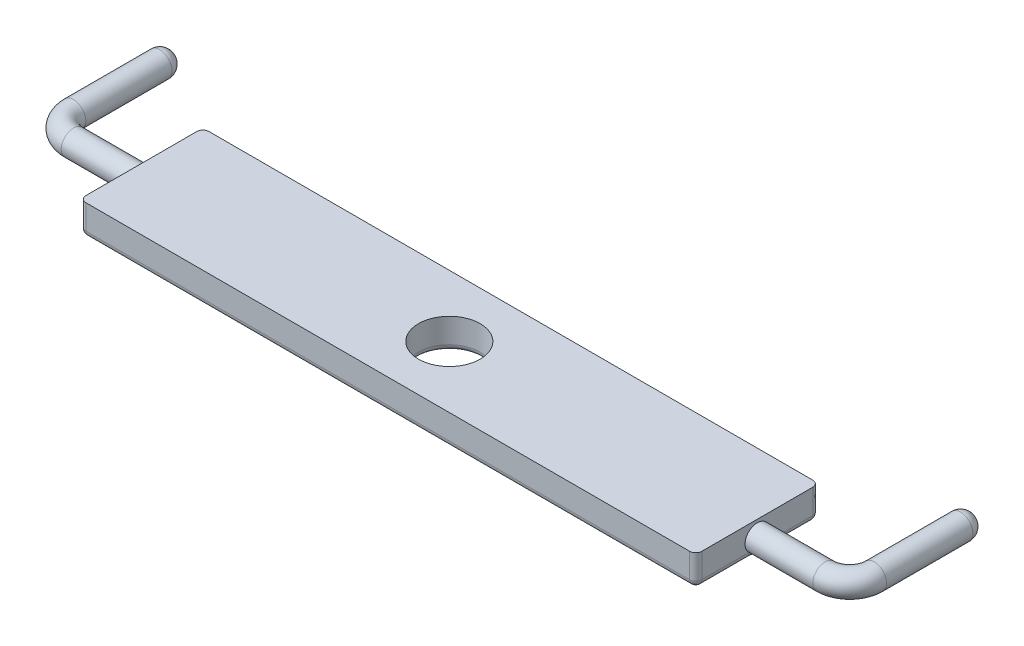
ISO-10303-21;
HEADER;
FILE_DESCRIPTION(('STEP AP214'),'2;1');
FILE_NAME('part.step','',(''),(''),'','','');
FILE_SCHEMA(('AUTOMOTIVE_DESIGN { 1 0 10303 214 1 1 1 1 }'));
ENDSEC;
DATA;
#1=APPLICATION_CONTEXT('core data for automotive mechanical design processes');
#2=APPLICATION_PROTOCOL_DEFINITION('international standard','automotive_design',2000,#1);
#3=PRODUCT_CONTEXT('',#1,'mechanical');
#4=PRODUCT('Part','Part','',(#3));
#5=PRODUCT_RELATED_PRODUCT_CATEGORY('part','',(#4));
#6=PRODUCT_DEFINITION_FORMATION('','',#4);
#7=PRODUCT_DEFINITION_CONTEXT('part definition',#1,'design');
#8=PRODUCT_DEFINITION('design','',#6,#7);
#9=PRODUCT_DEFINITION_SHAPE('','',#8);
#10=(LENGTH_UNIT() NAMED_UNIT(*) SI_UNIT(.MILLI.,.METRE.));
#11=(NAMED_UNIT(*) PLANE_ANGLE_UNIT() SI_UNIT($,.RADIAN.));
#12=(NAMED_UNIT(*) SI_UNIT($,.STERADIAN.) SOLID_ANGLE_UNIT());
#13=UNCERTAINTY_MEASURE_WITH_UNIT(LENGTH_MEASURE(1.E-05),#10,'distance_accuracy_value','');
#14=(GEOMETRIC_REPRESENTATION_CONTEXT(3) GLOBAL_UNCERTAINTY_ASSIGNED_CONTEXT((#13)) GLOBAL_UNIT_ASSIGNED_CONTEXT((#10,
#11,#12)) REPRESENTATION_CONTEXT('',''));
#15=CARTESIAN_POINT('',(0.,0.,0.));
#16=DIRECTION('',(0.,0.,1.));
#17=DIRECTION('',(1.,0.,0.));
#18=AXIS2_PLACEMENT_3D('',#15,#16,#17);
#19=CARTESIAN_POINT('',(-25.,1.25,-5.));
#20=DIRECTION('',(1.,0.,0.));
#21=DIRECTION('',(0.,0.,-1.));
#22=AXIS2_PLACEMENT_3D('',#19,#20,#21);
#23=PLANE('',#22);
#24=DIRECTION('',(0.,0.,1.));
#25=VECTOR('',#24,1.);
#26=CARTESIAN_POINT('',(-25.,1.25,-5.));
#27=LINE('',#26,#25);
#28=CARTESIAN_POINT('',(-25.,1.25,-4.5));
#29=VERTEX_POINT('',#28);
#30=CARTESIAN_POINT('',(-25.,1.25,4.5));
#31=VERTEX_POINT('',#30);
#32=EDGE_CURVE('E311',#29,#31,#27,.T.);
#33=ORIENTED_EDGE('',*,*,#32,.F.);
#34=DIRECTION('',(0.,-1.,0.));
#35=VECTOR('',#34,1.);
#36=CARTESIAN_POINT('',(-25.,1.25,-4.5));
#37=LINE('',#36,#35);
#38=CARTESIAN_POINT('',(-25.,-0.75,-4.5));
#39=VERTEX_POINT('',#38);
#40=EDGE_CURVE('E313',#29,#39,#37,.T.);
#41=ORIENTED_EDGE('',*,*,#40,.T.);
#42=DIRECTION('',(0.,0.,1.));
#43=VECTOR('',#42,1.);
#44=CARTESIAN_POINT('',(-25.,-0.75,5.));
#45=LINE('',#44,#43);
#46=CARTESIAN_POINT('',(-25.,-0.75,-0.661437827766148));
#47=VERTEX_POINT('',#46);
#48=EDGE_CURVE('E272',#39,#47,#45,.T.);
#49=ORIENTED_EDGE('',*,*,#48,.T.);
#50=CARTESIAN_POINT('',(-25.,0.,0.));
#51=DIRECTION('',(-1.,0.,0.));
#52=DIRECTION('',(0.,0.,1.));
#53=AXIS2_PLACEMENT_3D('',#50,#51,#52);
#54=CIRCLE('',#53,1.);
#55=CARTESIAN_POINT('',(-25.,-0.75,0.661437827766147));
#56=VERTEX_POINT('',#55);
#57=EDGE_CURVE('E449',#56,#47,#54,.T.);
#58=ORIENTED_EDGE('',*,*,#57,.F.);
#59=DIRECTION('',(0.,0.,1.));
#60=VECTOR('',#59,1.);
#61=CARTESIAN_POINT('',(-25.,-0.75,5.));
#62=LINE('',#61,#60);
#63=CARTESIAN_POINT('',(-25.,-0.75,4.5));
#64=VERTEX_POINT('',#63);
#65=EDGE_CURVE('E269',#56,#64,#62,.T.);
#66=ORIENTED_EDGE('',*,*,#65,.T.);
#67=DIRECTION('',(0.,-1.,0.));
#68=VECTOR('',#67,1.);
#69=CARTESIAN_POINT('',(-25.,1.25,4.5));
#70=LINE('',#69,#68);
#71=EDGE_CURVE('E316',#64,#31,#70,.F.);
#72=ORIENTED_EDGE('',*,*,#71,.T.);
#73=EDGE_LOOP('',(#33,#41,#49,#58,#66,#72));
#74=FACE_BOUND('',#73,.T.);
#75=ADVANCED_FACE('F34',(#74),#23,.F.);
#76=CARTESIAN_POINT('',(25.,1.25,-5.));
#77=DIRECTION('',(-1.,0.,0.));
#78=DIRECTION('',(0.,0.,1.));
#79=AXIS2_PLACEMENT_3D('',#76,#77,#78);
#80=PLANE('',#79);
#81=DIRECTION('',(0.,0.,-1.));
#82=VECTOR('',#81,1.);
#83=CARTESIAN_POINT('',(25.,-0.75,-5.));
#84=LINE('',#83,#82);
#85=CARTESIAN_POINT('',(25.,-0.75,-0.661437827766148));
#86=VERTEX_POINT('',#85);
#87=CARTESIAN_POINT('',(25.,-0.75,-4.5));
#88=VERTEX_POINT('',#87);
#89=EDGE_CURVE('E276',#86,#88,#84,.T.);
#90=ORIENTED_EDGE('',*,*,#89,.T.);
#91=DIRECTION('',(0.,-1.,0.));
#92=VECTOR('',#91,1.);
#93=CARTESIAN_POINT('',(25.,1.25,-4.5));
#94=LINE('',#93,#92);
#95=CARTESIAN_POINT('',(25.,1.25,-4.5));
#96=VERTEX_POINT('',#95);
#97=EDGE_CURVE('E342',#88,#96,#94,.F.);
#98=ORIENTED_EDGE('',*,*,#97,.T.);
#99=DIRECTION('',(0.,0.,-1.));
#100=VECTOR('',#99,1.);
#101=CARTESIAN_POINT('',(25.,1.25,-5.));
#102=LINE('',#101,#100);
#103=CARTESIAN_POINT('',(25.,1.25,4.5));
#104=VERTEX_POINT('',#103);
#105=EDGE_CURVE('E469',#104,#96,#102,.T.);
#106=ORIENTED_EDGE('',*,*,#105,.F.);
#107=DIRECTION('',(0.,-1.,0.));
#108=VECTOR('',#107,1.);
#109=CARTESIAN_POINT('',(25.,1.25,4.5));
#110=LINE('',#109,#108);
#111=CARTESIAN_POINT('',(25.,-0.75,4.5));
#112=VERTEX_POINT('',#111);
#113=EDGE_CURVE('E340',#104,#112,#110,.T.);
#114=ORIENTED_EDGE('',*,*,#113,.T.);
#115=DIRECTION('',(0.,0.,-1.));
#116=VECTOR('',#115,1.);
#117=CARTESIAN_POINT('',(25.,-0.75,-5.));
#118=LINE('',#117,#116);
#119=CARTESIAN_POINT('',(25.,-0.75,0.661437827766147));
#120=VERTEX_POINT('',#119);
#121=EDGE_CURVE('E279',#112,#120,#118,.T.);
#122=ORIENTED_EDGE('',*,*,#121,.T.);
#123=CARTESIAN_POINT('',(25.,0.,0.));
#124=DIRECTION('',(1.,0.,0.));
#125=DIRECTION('',(0.,0.,-1.));
#126=AXIS2_PLACEMENT_3D('',#123,#124,#125);
#127=CIRCLE('',#126,1.);
#128=EDGE_CURVE('E460',#86,#120,#127,.T.);
#129=ORIENTED_EDGE('',*,*,#128,.F.);
#130=EDGE_LOOP('',(#90,#98,#106,#114,#122,#129));
#131=FACE_BOUND('',#130,.T.);
#132=ADVANCED_FACE('F200',(#131),#80,.F.);
#133=CARTESIAN_POINT('',(25.,1.25,5.));
#134=DIRECTION('',(0.,-1.,0.));
#135=DIRECTION('',(0.,0.,-1.));
#136=AXIS2_PLACEMENT_3D('',#133,#134,#135);
#137=PLANE('',#136);
#138=DIRECTION('',(-1.,0.,0.));
#139=VECTOR('',#138,1.);
#140=CARTESIAN_POINT('',(25.,1.25,-5.));
#141=LINE('',#140,#139);
#142=CARTESIAN_POINT('',(24.5,1.25,-5.));
#143=VERTEX_POINT('',#142);
#144=CARTESIAN_POINT('',(-24.5,1.25,-5.));
#145=VERTEX_POINT('',#144);
#146=EDGE_CURVE('E318',#143,#145,#141,.T.);
#147=ORIENTED_EDGE('',*,*,#146,.T.);
#148=CARTESIAN_POINT('',(-24.5,1.25,-4.5));
#149=DIRECTION('',(0.,-1.,0.));
#150=DIRECTION('',(0.,0.,-1.));
#151=AXIS2_PLACEMENT_3D('',#148,#149,#150);
#152=CIRCLE('',#151,0.5);
#153=EDGE_CURVE('E325',#145,#29,#152,.F.);
#154=ORIENTED_EDGE('',*,*,#153,.T.);
#155=ORIENTED_EDGE('',*,*,#32,.T.);
#156=CARTESIAN_POINT('',(-24.5,1.25,4.5));
#157=DIRECTION('',(0.,-1.,0.));
#158=DIRECTION('',(0.,0.,-1.));
#159=AXIS2_PLACEMENT_3D('',#156,#157,#158);
#160=CIRCLE('',#159,0.5);
#161=CARTESIAN_POINT('',(-24.5,1.25,5.));
#162=VERTEX_POINT('',#161);
#163=EDGE_CURVE('E56',#31,#162,#160,.F.);
#164=ORIENTED_EDGE('',*,*,#163,.T.);
#165=DIRECTION('',(1.,0.,0.));
#166=VECTOR('',#165,1.);
#167=CARTESIAN_POINT('',(25.,1.25,5.));
#168=LINE('',#167,#166);
#169=CARTESIAN_POINT('',(24.5,1.25,5.));
#170=VERTEX_POINT('',#169);
#171=EDGE_CURVE('E317',#162,#170,#168,.T.);
#172=ORIENTED_EDGE('',*,*,#171,.T.);
#173=CARTESIAN_POINT('',(24.5,1.25,4.5));
#174=DIRECTION('',(0.,-1.,0.));
#175=DIRECTION('',(0.,0.,-1.));
#176=AXIS2_PLACEMENT_3D('',#173,#174,#175);
#177=CIRCLE('',#176,0.5);
#178=EDGE_CURVE('E334',#170,#104,#177,.F.);
#179=ORIENTED_EDGE('',*,*,#178,.T.);
#180=ORIENTED_EDGE('',*,*,#105,.T.);
#181=CARTESIAN_POINT('',(24.5,1.25,-4.5));
#182=DIRECTION('',(0.,-1.,0.));
#183=DIRECTION('',(0.,0.,-1.));
#184=AXIS2_PLACEMENT_3D('',#181,#182,#183);
#185=CIRCLE('',#184,0.5);
#186=EDGE_CURVE('E337',#96,#143,#185,.F.);
#187=ORIENTED_EDGE('',*,*,#186,.T.);
#188=EDGE_LOOP('',(#147,#154,#155,#164,#172,#179,#180,#187));
#189=FACE_BOUND('',#188,.T.);
#190=CARTESIAN_POINT('',(0.,1.25,0.));
#191=DIRECTION('',(0.,1.,0.));
#192=DIRECTION('',(0.,0.,1.));
#193=AXIS2_PLACEMENT_3D('',#190,#191,#192);
#194=CIRCLE('',#193,2.5);
#195=CARTESIAN_POINT('',(0.,1.25,2.5));
#196=VERTEX_POINT('',#195);
#197=EDGE_CURVE('E466',#196,#196,#194,.T.);
#198=ORIENTED_EDGE('',*,*,#197,.F.);
#199=EDGE_LOOP('',(#198));
#200=FACE_BOUND('',#199,.T.);
#201=ADVANCED_FACE('F228',(#189,#200),#137,.F.);
#202=CARTESIAN_POINT('',(25.,-1.25,5.));
#203=DIRECTION('',(0.,-1.,0.));
#204=DIRECTION('',(0.,0.,-1.));
#205=AXIS2_PLACEMENT_3D('',#202,#203,#204);
#206=PLANE('',#205);
#207=CARTESIAN_POINT('',(0.,-1.25,0.));
#208=DIRECTION('',(0.,-1.,0.));
#209=DIRECTION('',(0.,0.,-1.));
#210=AXIS2_PLACEMENT_3D('',#207,#208,#209);
#211=CIRCLE('',#210,3.);
#212=CARTESIAN_POINT('',(0.,-1.25,-3.));
#213=VERTEX_POINT('',#212);
#214=EDGE_CURVE('E258',#213,#213,#211,.F.);
#215=ORIENTED_EDGE('',*,*,#214,.T.);
#216=EDGE_LOOP('',(#215));
#217=FACE_BOUND('',#216,.T.);
#218=DIRECTION('',(0.,0.,1.));
#219=VECTOR('',#218,1.);
#220=CARTESIAN_POINT('',(-24.5,-1.25,-5.));
#221=LINE('',#220,#219);
#222=CARTESIAN_POINT('',(-24.5,-1.25,4.5));
#223=VERTEX_POINT('',#222);
#224=CARTESIAN_POINT('',(-24.5,-1.25,0.661437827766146));
#225=VERTEX_POINT('',#224);
#226=EDGE_CURVE('E413',#223,#225,#221,.F.);
#227=ORIENTED_EDGE('',*,*,#226,.T.);
#228=CARTESIAN_POINT('',(-25.,-0.627274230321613,0.778798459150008));
#229=CARTESIAN_POINT('',(-25.1496790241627,-1.25,0.729232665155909));
#230=CARTESIAN_POINT('',(-24.5398681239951,-1.25,0.93116985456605));
#231=CARTESIAN_POINT('',(-25.,-0.636103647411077,0.771681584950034));
#232=CARTESIAN_POINT('',(-25.1378611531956,-1.25,0.731566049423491));
#233=CARTESIAN_POINT('',(-24.5327034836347,-1.25,0.90954230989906));
#234=CARTESIAN_POINT('',(-25.,-0.645336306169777,0.764002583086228));
#235=CARTESIAN_POINT('',(-25.1252870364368,-1.25,0.731809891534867));
#236=CARTESIAN_POINT('',(-24.5266227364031,-1.25,0.887579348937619));
#237=CARTESIAN_POINT('',(-25.,-0.664518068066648,0.74738139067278));
#238=CARTESIAN_POINT('',(-25.0996926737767,-1.25,0.728104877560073));
#239=CARTESIAN_POINT('',(-24.5164509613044,-1.25,0.843205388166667));
#240=CARTESIAN_POINT('',(-25.,-0.674466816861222,0.738439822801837));
#241=CARTESIAN_POINT('',(-25.0866950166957,-1.25,0.724256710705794));
#242=CARTESIAN_POINT('',(-24.5123589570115,-1.25,0.820794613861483));
#243=CARTESIAN_POINT('',(-25.,-0.694914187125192,0.719228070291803));
#244=CARTESIAN_POINT('',(-25.0610904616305,-1.25,0.712657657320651));
#245=CARTESIAN_POINT('',(-24.5060064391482,-1.25,0.775913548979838));
#246=CARTESIAN_POINT('',(-25.,-0.705407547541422,0.708969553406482));
#247=CARTESIAN_POINT('',(-25.0484848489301,-1.25,0.705033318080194));
#248=CARTESIAN_POINT('',(-24.503730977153,-1.25,0.7534453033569));
#249=CARTESIAN_POINT('',(-25.,-0.726894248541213,0.686921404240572));
#250=CARTESIAN_POINT('',(-25.0240852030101,-1.25,0.686282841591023));
#251=CARTESIAN_POINT('',(-24.5007470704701,-1.25,0.708422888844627));
#252=CARTESIAN_POINT('',(-25.,-0.737887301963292,0.675132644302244));
#253=CARTESIAN_POINT('',(-25.0122761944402,-1.25,0.67524036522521));
#254=CARTESIAN_POINT('',(-24.5000377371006,-1.25,0.685868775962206));
#255=CARTESIAN_POINT('',(-25.,-0.772304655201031,0.636224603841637));
#256=CARTESIAN_POINT('',(-24.9781551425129,-1.25,0.63688871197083));
#257=CARTESIAN_POINT('',(-24.4999263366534,-1.25,0.616449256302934));
#258=CARTESIAN_POINT('',(-25.,-0.796355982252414,0.60627766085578));
#259=CARTESIAN_POINT('',(-24.9572182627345,-1.25,0.604358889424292));
#260=CARTESIAN_POINT('',(-24.5027575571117,-1.25,0.569583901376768));
#261=CARTESIAN_POINT('',(-25.,-0.844286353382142,0.537528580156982));
#262=CARTESIAN_POINT('',(-24.9220454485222,-1.25,0.528942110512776));
#263=CARTESIAN_POINT('',(-24.5120492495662,-1.25,0.476170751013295));
#264=CARTESIAN_POINT('',(-25.,-0.868164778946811,0.498703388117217));
#265=CARTESIAN_POINT('',(-24.9074986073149,-1.25,0.486326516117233));
#266=CARTESIAN_POINT('',(-24.5185192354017,-1.25,0.429624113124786));
#267=CARTESIAN_POINT('',(-25.,-0.912823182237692,0.411286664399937));
#268=CARTESIAN_POINT('',(-24.8847516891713,-1.25,0.393784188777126));
#269=CARTESIAN_POINT('',(-24.5325690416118,-1.25,0.336796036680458));
#270=CARTESIAN_POINT('',(-25.,-0.933608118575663,0.362711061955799));
#271=CARTESIAN_POINT('',(-24.8762559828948,-1.25,0.343822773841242));
#272=CARTESIAN_POINT('',(-24.5401470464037,-1.25,0.29051429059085));
#273=CARTESIAN_POINT('',(-25.,-0.968167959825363,0.256359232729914));
#274=CARTESIAN_POINT('',(-24.864116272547,-1.25,0.239053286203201));
#275=CARTESIAN_POINT('',(-24.5535027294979,-1.25,0.197768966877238));
#276=CARTESIAN_POINT('',(-25.,-0.981961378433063,0.198607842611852));
#277=CARTESIAN_POINT('',(-24.8602795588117,-1.25,0.183827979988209));
#278=CARTESIAN_POINT('',(-24.5592851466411,-1.25,0.151306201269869));
#279=CARTESIAN_POINT('',(-25.,-0.994706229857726,0.107420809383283));
#280=CARTESIAN_POINT('',(-24.8569502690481,-1.25,0.0987567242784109));
#281=CARTESIAN_POINT('',(-24.5647003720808,-1.25,0.0808839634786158));
#282=CARTESIAN_POINT('',(-25.,-0.997618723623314,0.0759435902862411));
#283=CARTESIAN_POINT('',(-24.8562401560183,-1.25,0.0697062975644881));
#284=CARTESIAN_POINT('',(-24.5659582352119,-1.25,0.0570586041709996));
#285=CARTESIAN_POINT('',(-25.,-1.00042260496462,0.0125484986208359));
#286=CARTESIAN_POINT('',(-24.8555585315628,-1.25,0.0115068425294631));
#287=CARTESIAN_POINT('',(-24.5671690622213,-1.25,0.00937552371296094));
#288=CARTESIAN_POINT('',(-25.,-1.00031420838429,-0.0193693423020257));
#289=CARTESIAN_POINT('',(-24.8555842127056,-1.25,-0.0177592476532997));
#290=CARTESIAN_POINT('',(-24.5671221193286,-1.25,-0.0144821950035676));
#291=CARTESIAN_POINT('',(-25.,-0.997078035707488,-0.082729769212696));
#292=CARTESIAN_POINT('',(-24.8563723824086,-1.25,-0.0759573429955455));
#293=CARTESIAN_POINT('',(-24.5657247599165,-1.25,-0.0621921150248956));
#294=CARTESIAN_POINT('',(-25.,-0.993945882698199,-0.11417159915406));
#295=CARTESIAN_POINT('',(-24.8571391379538,-1.25,-0.105005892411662));
#296=CARTESIAN_POINT('',(-24.5643724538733,-1.25,-0.0860442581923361));
#297=CARTESIAN_POINT('',(-25.,-0.984939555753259,-0.175677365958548));
#298=CARTESIAN_POINT('',(-24.8595069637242,-1.25,-0.162304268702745));
#299=CARTESIAN_POINT('',(-24.5605568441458,-1.25,-0.133661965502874));
#300=CARTESIAN_POINT('',(-25.,-0.979064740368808,-0.205740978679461));
#301=CARTESIAN_POINT('',(-24.8611178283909,-1.25,-0.190657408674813));
#302=CARTESIAN_POINT('',(-24.5580932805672,-1.25,-0.15742750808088));
#303=CARTESIAN_POINT('',(-25.,-0.957955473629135,-0.293109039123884));
#304=CARTESIAN_POINT('',(-24.8675125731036,-1.25,-0.274603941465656));
#305=CARTESIAN_POINT('',(-24.549486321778,-1.25,-0.228795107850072));
#306=CARTESIAN_POINT('',(-25.,-0.939259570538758,-0.347273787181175));
#307=CARTESIAN_POINT('',(-24.8739044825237,-1.25,-0.328465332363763));
#308=CARTESIAN_POINT('',(-24.5421387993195,-1.25,-0.276239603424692));
#309=CARTESIAN_POINT('',(-25.,-0.897045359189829,-0.445180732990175));
#310=CARTESIAN_POINT('',(-24.8922070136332,-1.25,-0.429053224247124));
#311=CARTESIAN_POINT('',(-24.5273582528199,-1.25,-0.371083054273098));
#312=CARTESIAN_POINT('',(-25.,-0.873529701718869,-0.488928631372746));
#313=CARTESIAN_POINT('',(-24.9043782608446,-1.25,-0.476008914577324));
#314=CARTESIAN_POINT('',(-24.5199252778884,-1.25,-0.418482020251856));
#315=CARTESIAN_POINT('',(-25.,-0.836071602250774,-0.549192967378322));
#316=CARTESIAN_POINT('',(-24.9279388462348,-1.25,-0.541154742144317));
#317=CARTESIAN_POINT('',(-24.5105523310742,-1.25,-0.492232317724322));
#318=CARTESIAN_POINT('',(-25.,-0.822586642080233,-0.569100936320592));
#319=CARTESIAN_POINT('',(-24.9374074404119,-1.25,-0.563062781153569));
#320=CARTESIAN_POINT('',(-24.5076460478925,-1.25,-0.518450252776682));
#321=CARTESIAN_POINT('',(-25.,-0.795656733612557,-0.606181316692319));
#322=CARTESIAN_POINT('',(-24.9582383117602,-1.25,-0.603627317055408));
#323=CARTESIAN_POINT('',(-24.5030897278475,-1.25,-0.570955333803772));
#324=CARTESIAN_POINT('',(-25.,-0.782211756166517,-0.623358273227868));
#325=CARTESIAN_POINT('',(-24.969653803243,-1.25,-0.622228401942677));
#326=CARTESIAN_POINT('',(-24.5014375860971,-1.25,-0.597242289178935));
#327=CARTESIAN_POINT('',(-25.,-0.755819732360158,-0.65510142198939));
#328=CARTESIAN_POINT('',(-24.994063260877,-1.25,-0.655496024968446));
#329=CARTESIAN_POINT('',(-24.4997860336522,-1.25,-0.649604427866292));
#330=CARTESIAN_POINT('',(-25.,-0.742868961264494,-0.669692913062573));
#331=CARTESIAN_POINT('',(-25.0070900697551,-1.25,-0.670114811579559));
#332=CARTESIAN_POINT('',(-24.4997696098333,-1.25,-0.675678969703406));
#333=CARTESIAN_POINT('',(-25.,-0.717567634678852,-0.69673489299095));
#334=CARTESIAN_POINT('',(-25.0344023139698,-1.25,-0.69511748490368));
#335=CARTESIAN_POINT('',(-24.5016992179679,-1.25,-0.727765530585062));
#336=CARTESIAN_POINT('',(-25.,-0.705217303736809,-0.709184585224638));
#337=CARTESIAN_POINT('',(-25.0487190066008,-1.25,-0.705382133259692));
#338=CARTESIAN_POINT('',(-24.5036459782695,-1.25,-0.753777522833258));
#339=CARTESIAN_POINT('',(-25.,-0.675887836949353,-0.737399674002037));
#340=CARTESIAN_POINT('',(-25.0847980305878,-1.25,-0.724784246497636));
#341=CARTESIAN_POINT('',(-24.5112452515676,-1.25,-0.817293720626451));
#342=CARTESIAN_POINT('',(-25.,-0.659345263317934,-0.752113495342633));
#343=CARTESIAN_POINT('',(-25.1066933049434,-1.25,-0.730771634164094));
#344=CARTESIAN_POINT('',(-24.5181766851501,-1.25,-0.85466782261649));
#345=CARTESIAN_POINT('',(-25.,-0.635877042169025,-0.771860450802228));
#346=CARTESIAN_POINT('',(-25.1381039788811,-1.25,-0.731354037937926));
#347=CARTESIAN_POINT('',(-24.5329988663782,-1.25,-0.91014946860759));
#348=CARTESIAN_POINT('',(-25.,-0.628172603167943,-0.778131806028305));
#349=CARTESIAN_POINT('',(-25.1486064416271,-1.25,-0.729972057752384));
#350=CARTESIAN_POINT('',(-24.5388008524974,-1.25,-0.928825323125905));
#351=CARTESIAN_POINT('',(-25.,-0.613344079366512,-0.789872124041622));
#352=CARTESIAN_POINT('',(-25.1685219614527,-1.25,-0.724174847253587));
#353=CARTESIAN_POINT('',(-24.5520172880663,-1.25,-0.965636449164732));
#354=CARTESIAN_POINT('',(-25.,-0.606221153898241,-0.795339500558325));
#355=CARTESIAN_POINT('',(-25.1778994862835,-1.25,-0.719694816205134));
#356=CARTESIAN_POINT('',(-24.5594348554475,-1.25,-0.983770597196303));
#357=CARTESIAN_POINT('',(-25.,-0.599411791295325,-0.800440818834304));
#358=CARTESIAN_POINT('',(-25.1863120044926,-1.25,-0.713774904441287));
#359=CARTESIAN_POINT('',(-24.5676978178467,-1.25,-1.00153287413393));
#360=(BOUNDED_SURFACE() B_SPLINE_SURFACE(3,2,((#228,#229,#230),(#231,#232,#233),(#234,#235,
#236),(#237,#238,#239),(#240,#241,#242),(#243,#244,#245),(#246,#247,#248),(#249,#250,#251),
(#252,#253,#254),(#255,#256,#257),(#258,#259,#260),(#261,#262,#263),(#264,#265,#266),(#267,#268,
#269),(#270,#271,#272),(#273,#274,#275),(#276,#277,#278),(#279,#280,#281),(#282,#283,#284),
(#285,#286,#287),(#288,#289,#290),(#291,#292,#293),(#294,#295,#296),(#297,#298,#299),(#300,#301,
#302),(#303,#304,#305),(#306,#307,#308),(#309,#310,#311),(#312,#313,#314),(#315,#316,#317),
(#318,#319,#320),(#321,#322,#323),(#324,#325,#326),(#327,#328,#329),(#330,#331,#332),(#333,#334,
#335),(#336,#337,#338),(#339,#340,#341),(#342,#343,#344),(#345,#346,#347),(#348,#349,#350),
(#351,#352,#353),(#354,#355,#356),(#357,#358,#359)),.UNSPECIFIED.,.F.,.F.,
.F.) B_SPLINE_SURFACE_WITH_KNOTS((4,2,2,2,2,2,2,2,2,2,2,2,2,2,2,2,2,2,2,2,2,4),(3,3),(0.,
0.0682896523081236,0.136545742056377,0.204234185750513,0.271884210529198,0.412454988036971,
0.553395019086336,0.694106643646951,0.834443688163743,0.905985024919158,0.977521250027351,
1.04916117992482,1.12081787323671,1.26481582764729,1.40873479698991,1.48784669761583,
1.56682552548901,1.64498280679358,1.72316909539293,1.8367619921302,1.8953652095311,
1.95408254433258),(0.,1.),
.UNSPECIFIED.) GEOMETRIC_REPRESENTATION_ITEM() RATIONAL_B_SPLINE_SURFACE(((1.,0.614226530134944,
1.),(1.,0.621416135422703,1.),(1.,0.628803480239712,1.),(1.,0.643874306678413,1.),(1.,
0.651557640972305,1.),(1.,0.667063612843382,1.),(1.,0.674884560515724,1.),(1.,0.690620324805,
1.),(1.,0.698535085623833,1.),(1.,0.722891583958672,1.),(1.,0.739328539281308,1.),(1.,
0.771063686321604,1.),(1.,0.786358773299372,1.),(1.,0.814258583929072,1.),(1.,0.826867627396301,
1.),(1.,0.847513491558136,1.),(1.,0.855562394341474,1.),(1.,0.862966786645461,1.),(1.,
0.864649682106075,1.),(1.,0.866269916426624,1.),(1.,0.866207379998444,1.),(1.,0.864337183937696,
1.),(1.,0.862526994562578,1.),(1.,0.857290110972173,1.),(1.,0.853863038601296,1.),(1.,
0.841441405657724,1.),(1.,0.830319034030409,1.),(1.,0.804492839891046,1.),(1.,0.789790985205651,
1.),(1.,0.765602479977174,1.),(1.,0.756748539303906,1.),(1.,0.738740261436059,1.),(1.,
0.729586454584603,1.),(1.,0.711268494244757,1.),(1.,0.702105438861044,1.),(1.,0.683850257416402,
1.),(1.,0.674758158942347,1.),(1.,0.652730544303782,1.),(1.,0.639919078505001,1.),(1.,
0.621222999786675,1.),(1.,0.614987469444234,1.),(1.,0.602811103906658,1.),(1.,0.596870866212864,
1.),(1.,0.591110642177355,1.))) REPRESENTATION_ITEM('') SURFACE());
#361=CARTESIAN_POINT('',(-24.5398681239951,-1.25,0.93116985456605));
#362=CARTESIAN_POINT('',(-24.5327034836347,-1.25,0.90954230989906));
#363=CARTESIAN_POINT('',(-24.5266227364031,-1.25,0.887579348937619));
#364=CARTESIAN_POINT('',(-24.5164509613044,-1.25,0.843205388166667));
#365=CARTESIAN_POINT('',(-24.5123589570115,-1.25,0.820794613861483));
#366=CARTESIAN_POINT('',(-24.5060064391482,-1.25,0.775913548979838));
#367=CARTESIAN_POINT('',(-24.503730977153,-1.25,0.7534453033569));
#368=CARTESIAN_POINT('',(-24.5007470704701,-1.25,0.708422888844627));
#369=CARTESIAN_POINT('',(-24.5000377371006,-1.25,0.685868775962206));
#370=CARTESIAN_POINT('',(-24.4999263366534,-1.25,0.616449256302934));
#371=CARTESIAN_POINT('',(-24.5027575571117,-1.25,0.569583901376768));
#372=CARTESIAN_POINT('',(-24.5120492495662,-1.25,0.476170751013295));
#373=CARTESIAN_POINT('',(-24.5185192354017,-1.25,0.429624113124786));
#374=CARTESIAN_POINT('',(-24.5325690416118,-1.25,0.336796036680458));
#375=CARTESIAN_POINT('',(-24.5401470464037,-1.25,0.29051429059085));
#376=CARTESIAN_POINT('',(-24.5535027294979,-1.25,0.197768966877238));
#377=CARTESIAN_POINT('',(-24.5592851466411,-1.25,0.151306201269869));
#378=CARTESIAN_POINT('',(-24.5647003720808,-1.25,0.0808839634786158));
#379=CARTESIAN_POINT('',(-24.5659582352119,-1.25,0.0570586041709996));
#380=CARTESIAN_POINT('',(-24.5671690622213,-1.25,0.00937552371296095));
#381=CARTESIAN_POINT('',(-24.5671221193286,-1.25,-0.0144821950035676));
#382=CARTESIAN_POINT('',(-24.5657247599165,-1.25,-0.0621921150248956));
#383=CARTESIAN_POINT('',(-24.5643724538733,-1.25,-0.0860442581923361));
#384=CARTESIAN_POINT('',(-24.5605568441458,-1.25,-0.133661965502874));
#385=CARTESIAN_POINT('',(-24.5580932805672,-1.25,-0.15742750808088));
#386=CARTESIAN_POINT('',(-24.549486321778,-1.25,-0.228795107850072));
#387=CARTESIAN_POINT('',(-24.5421387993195,-1.25,-0.276239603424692));
#388=CARTESIAN_POINT('',(-24.5273582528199,-1.25,-0.371083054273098));
#389=CARTESIAN_POINT('',(-24.5199252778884,-1.25,-0.418482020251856));
#390=CARTESIAN_POINT('',(-24.5105523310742,-1.25,-0.492232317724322));
#391=CARTESIAN_POINT('',(-24.5076460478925,-1.25,-0.518450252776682));
#392=CARTESIAN_POINT('',(-24.5030897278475,-1.25,-0.570955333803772));
#393=CARTESIAN_POINT('',(-24.5014375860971,-1.25,-0.597242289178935));
#394=CARTESIAN_POINT('',(-24.4997860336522,-1.25,-0.649604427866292));
#395=CARTESIAN_POINT('',(-24.4997696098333,-1.25,-0.675678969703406));
#396=CARTESIAN_POINT('',(-24.5016992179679,-1.25,-0.727765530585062));
#397=CARTESIAN_POINT('',(-24.5036459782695,-1.25,-0.753777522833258));
#398=CARTESIAN_POINT('',(-24.5112452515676,-1.25,-0.817293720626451));
#399=CARTESIAN_POINT('',(-24.5181766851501,-1.25,-0.85466782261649));
#400=CARTESIAN_POINT('',(-24.5329988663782,-1.25,-0.91014946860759));
#401=CARTESIAN_POINT('',(-24.5388008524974,-1.25,-0.928825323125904));
#402=CARTESIAN_POINT('',(-24.5520172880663,-1.25,-0.965636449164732));
#403=CARTESIAN_POINT('',(-24.5594348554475,-1.25,-0.983770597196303));
#404=CARTESIAN_POINT('',(-24.5676978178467,-1.25,-1.00153287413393));
#405=B_SPLINE_CURVE_WITH_KNOTS('',3,(#361,#362,#363,#364,#365,#366,#367,#368,#369,#370,#371,
#372,#373,#374,#375,#376,#377,#378,#379,#380,#381,#382,#383,#384,#385,#386,#387,#388,#389,#390,
#391,#392,#393,#394,#395,#396,#397,#398,#399,#400,#401,#402,#403,#404),.UNSPECIFIED.,.F.,.F.,(4,
2,2,2,2,2,2,2,2,2,2,2,2,2,2,2,2,2,2,2,2,4),(0.,0.0682896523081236,0.136545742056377,
0.204234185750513,0.271884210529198,0.412454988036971,0.553395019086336,0.694106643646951,
0.834443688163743,0.905985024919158,0.977521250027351,1.04916117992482,1.12081787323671,
1.26481582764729,1.40873479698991,1.48784669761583,1.56682552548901,1.64498280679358,
1.72316909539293,1.8367619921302,1.8953652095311,1.95408254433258),.UNSPECIFIED.);
#406=CARTESIAN_POINT('',(-24.5,-1.25,-0.661437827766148));
#407=VERTEX_POINT('',#406);
#408=EDGE_CURVE('E252',#225,#407,#405,.T.);
#409=ORIENTED_EDGE('',*,*,#408,.T.);
#410=DIRECTION('',(0.,0.,1.));
#411=VECTOR('',#410,1.);
#412=CARTESIAN_POINT('',(-24.5,-1.25,-5.));
#413=LINE('',#412,#411);
#414=CARTESIAN_POINT('',(-24.5,-1.25,-4.5));
#415=VERTEX_POINT('',#414);
#416=EDGE_CURVE('E259',#407,#415,#413,.F.);
#417=ORIENTED_EDGE('',*,*,#416,.T.);
#418=DIRECTION('',(-1.,0.,0.));
#419=VECTOR('',#418,1.);
#420=CARTESIAN_POINT('',(25.,-1.25,-4.5));
#421=LINE('',#420,#419);
#422=CARTESIAN_POINT('',(24.5,-1.25,-4.5));
#423=VERTEX_POINT('',#422);
#424=EDGE_CURVE('E418',#415,#423,#421,.F.);
#425=ORIENTED_EDGE('',*,*,#424,.T.);
#426=DIRECTION('',(0.,0.,-1.));
#427=VECTOR('',#426,1.);
#428=CARTESIAN_POINT('',(24.5,-1.25,5.));
#429=LINE('',#428,#427);
#430=CARTESIAN_POINT('',(24.5,-1.25,-0.661437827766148));
#431=VERTEX_POINT('',#430);
#432=EDGE_CURVE('E145',#423,#431,#429,.F.);
#433=ORIENTED_EDGE('',*,*,#432,.T.);
#434=CARTESIAN_POINT('',(25.,-0.627274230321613,-0.778798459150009));
#435=CARTESIAN_POINT('',(25.1496790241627,-1.25,-0.729232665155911));
#436=CARTESIAN_POINT('',(24.5398681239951,-1.25,-0.931169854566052));
#437=CARTESIAN_POINT('',(25.,-0.636103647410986,-0.771681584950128));
#438=CARTESIAN_POINT('',(25.1378611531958,-1.25,-0.731566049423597));
#439=CARTESIAN_POINT('',(24.5327034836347,-1.25,-0.909542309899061));
#440=CARTESIAN_POINT('',(25.,-0.645336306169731,-0.764002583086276));
#441=CARTESIAN_POINT('',(25.1252870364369,-1.25,-0.73180989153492));
#442=CARTESIAN_POINT('',(24.5266227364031,-1.25,-0.887579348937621));
#443=CARTESIAN_POINT('',(25.,-0.664518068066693,-0.747381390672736));
#444=CARTESIAN_POINT('',(25.0996926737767,-1.25,-0.728104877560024));
#445=CARTESIAN_POINT('',(24.5164509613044,-1.25,-0.843205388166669));
#446=CARTESIAN_POINT('',(25.,-0.674466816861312,-0.738439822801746));
#447=CARTESIAN_POINT('',(25.0866950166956,-1.25,-0.724256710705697));
#448=CARTESIAN_POINT('',(24.5123589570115,-1.25,-0.820794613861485));
#449=CARTESIAN_POINT('',(25.,-0.694914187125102,-0.719228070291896));
#450=CARTESIAN_POINT('',(25.0610904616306,-1.25,-0.712657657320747));
#451=CARTESIAN_POINT('',(24.5060064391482,-1.25,-0.77591354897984));
#452=CARTESIAN_POINT('',(25.,-0.705407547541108,-0.708969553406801));
#453=CARTESIAN_POINT('',(25.0484848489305,-1.25,-0.705033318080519));
#454=CARTESIAN_POINT('',(24.503730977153,-1.25,-0.753445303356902));
#455=CARTESIAN_POINT('',(25.,-0.726894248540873,-0.686921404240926));
#456=CARTESIAN_POINT('',(25.0240852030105,-1.25,-0.686282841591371));
#457=CARTESIAN_POINT('',(24.5007470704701,-1.25,-0.708422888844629));
#458=CARTESIAN_POINT('',(25.,-0.737887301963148,-0.675132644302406));
#459=CARTESIAN_POINT('',(25.0122761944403,-1.25,-0.675240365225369));
#460=CARTESIAN_POINT('',(24.5000377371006,-1.25,-0.685868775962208));
#461=CARTESIAN_POINT('',(25.,-0.772304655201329,-0.636224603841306));
#462=CARTESIAN_POINT('',(24.9781551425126,-1.25,-0.636888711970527));
#463=CARTESIAN_POINT('',(24.4999263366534,-1.25,-0.616449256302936));
#464=CARTESIAN_POINT('',(25.,-0.79635598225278,-0.606277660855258));
#465=CARTESIAN_POINT('',(24.9572182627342,-1.25,-0.604358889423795));
#466=CARTESIAN_POINT('',(24.5027575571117,-1.25,-0.569583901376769));
#467=CARTESIAN_POINT('',(25.,-0.844286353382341,-0.537528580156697));
#468=CARTESIAN_POINT('',(24.922045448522,-1.25,-0.528942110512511));
#469=CARTESIAN_POINT('',(24.5120492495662,-1.25,-0.476170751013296));
#470=CARTESIAN_POINT('',(25.,-0.868164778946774,-0.498703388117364));
#471=CARTESIAN_POINT('',(24.9074986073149,-1.25,-0.486326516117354));
#472=CARTESIAN_POINT('',(24.5185192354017,-1.25,-0.429624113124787));
#473=CARTESIAN_POINT('',(25.,-0.912823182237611,-0.411286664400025));
#474=CARTESIAN_POINT('',(24.8847516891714,-1.25,-0.393784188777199));
#475=CARTESIAN_POINT('',(24.5325690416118,-1.25,-0.336796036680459));
#476=CARTESIAN_POINT('',(25.,-0.933608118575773,-0.362711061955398));
#477=CARTESIAN_POINT('',(24.8762559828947,-1.25,-0.34382277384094));
#478=CARTESIAN_POINT('',(24.5401470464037,-1.25,-0.290514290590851));
#479=CARTESIAN_POINT('',(25.,-0.968167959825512,-0.256359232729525));
#480=CARTESIAN_POINT('',(24.8641162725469,-1.25,-0.239053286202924));
#481=CARTESIAN_POINT('',(24.5535027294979,-1.25,-0.19776896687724));
#482=CARTESIAN_POINT('',(25.,-0.981961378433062,-0.198607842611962));
#483=CARTESIAN_POINT('',(24.8602795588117,-1.25,-0.183827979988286));
#484=CARTESIAN_POINT('',(24.5592851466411,-1.25,-0.15130620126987));
#485=CARTESIAN_POINT('',(25.,-0.994706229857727,-0.10742080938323));
#486=CARTESIAN_POINT('',(24.8569502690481,-1.25,-0.0987567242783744));
#487=CARTESIAN_POINT('',(24.5647003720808,-1.25,-0.0808839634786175));
#488=CARTESIAN_POINT('',(25.,-0.997618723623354,-0.0759435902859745));
#489=CARTESIAN_POINT('',(24.8562401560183,-1.25,-0.0697062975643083));
#490=CARTESIAN_POINT('',(24.5659582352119,-1.25,-0.0570586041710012));
#491=CARTESIAN_POINT('',(25.,-1.00042260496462,-0.0125484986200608));
#492=CARTESIAN_POINT('',(24.8555585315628,-1.25,-0.0115068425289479));
#493=CARTESIAN_POINT('',(24.5671690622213,-1.25,-0.00937552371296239));
#494=CARTESIAN_POINT('',(25.,-1.00031420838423,0.0193693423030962));
#495=CARTESIAN_POINT('',(24.8555842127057,-1.25,0.0177592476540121));
#496=CARTESIAN_POINT('',(24.5671221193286,-1.25,0.0144821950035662));
#497=CARTESIAN_POINT('',(25.,-0.997078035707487,0.0827297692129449));
#498=CARTESIAN_POINT('',(24.8563723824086,-1.25,0.0759573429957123));
#499=CARTESIAN_POINT('',(24.5657247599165,-1.25,0.0621921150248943));
#500=CARTESIAN_POINT('',(25.,-0.993945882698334,0.11417159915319));
#501=CARTESIAN_POINT('',(24.8571391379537,-1.25,0.105005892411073));
#502=CARTESIAN_POINT('',(24.5643724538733,-1.25,0.0860442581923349));
#503=CARTESIAN_POINT('',(25.,-0.984939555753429,0.175677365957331));
#504=CARTESIAN_POINT('',(24.8595069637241,-1.25,0.162304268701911));
#505=CARTESIAN_POINT('',(24.5605568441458,-1.25,0.133661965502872));
#506=CARTESIAN_POINT('',(25.,-0.979064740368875,0.205740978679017));
#507=CARTESIAN_POINT('',(24.8611178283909,-1.25,0.190657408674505));
#508=CARTESIAN_POINT('',(24.5580932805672,-1.25,0.157427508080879));
#509=CARTESIAN_POINT('',(25.,-0.957955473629,0.293109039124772));
#510=CARTESIAN_POINT('',(24.8675125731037,-1.25,0.274603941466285));
#511=CARTESIAN_POINT('',(24.549486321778,-1.25,0.22879510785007));
#512=CARTESIAN_POINT('',(25.,-0.939259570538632,0.347273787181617));
#513=CARTESIAN_POINT('',(24.8739044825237,-1.25,0.328465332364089));
#514=CARTESIAN_POINT('',(24.5421387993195,-1.25,0.27623960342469));
#515=CARTESIAN_POINT('',(25.,-0.897045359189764,0.445180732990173));
#516=CARTESIAN_POINT('',(24.8922070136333,-1.25,0.429053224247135));
#517=CARTESIAN_POINT('',(24.5273582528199,-1.25,0.371083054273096));
#518=CARTESIAN_POINT('',(25.,-0.873529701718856,0.488928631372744));
#519=CARTESIAN_POINT('',(24.9043782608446,-1.25,0.476008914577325));
#520=CARTESIAN_POINT('',(24.5199252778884,-1.25,0.418482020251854));
#521=CARTESIAN_POINT('',(25.,-0.836071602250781,0.549192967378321));
#522=CARTESIAN_POINT('',(24.9279388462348,-1.25,0.541154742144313));
#523=CARTESIAN_POINT('',(24.5105523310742,-1.25,0.49223231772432));
#524=CARTESIAN_POINT('',(25.,-0.822586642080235,0.56910093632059));
#525=CARTESIAN_POINT('',(24.9374074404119,-1.25,0.563062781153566));
#526=CARTESIAN_POINT('',(24.5076460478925,-1.25,0.518450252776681));
#527=CARTESIAN_POINT('',(25.,-0.795656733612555,0.606181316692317));
#528=CARTESIAN_POINT('',(24.9582383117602,-1.25,0.603627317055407));
#529=CARTESIAN_POINT('',(24.5030897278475,-1.25,0.57095533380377));
#530=CARTESIAN_POINT('',(25.,-0.782211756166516,0.623358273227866));
#531=CARTESIAN_POINT('',(24.9696538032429,-1.25,0.622228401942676));
#532=CARTESIAN_POINT('',(24.5014375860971,-1.25,0.597242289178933));
#533=CARTESIAN_POINT('',(25.,-0.755819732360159,0.655101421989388));
#534=CARTESIAN_POINT('',(24.994063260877,-1.25,0.655496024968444));
#535=CARTESIAN_POINT('',(24.4997860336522,-1.25,0.64960442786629));
#536=CARTESIAN_POINT('',(25.,-0.742868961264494,0.669692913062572));
#537=CARTESIAN_POINT('',(25.0070900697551,-1.25,0.670114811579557));
#538=CARTESIAN_POINT('',(24.4997696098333,-1.25,0.675678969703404));
#539=CARTESIAN_POINT('',(25.,-0.717567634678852,0.696734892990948));
#540=CARTESIAN_POINT('',(25.0344023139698,-1.25,0.695117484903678));
#541=CARTESIAN_POINT('',(24.5016992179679,-1.25,0.72776553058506));
#542=CARTESIAN_POINT('',(25.,-0.705217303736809,0.709184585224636));
#543=CARTESIAN_POINT('',(25.0487190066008,-1.25,0.705382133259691));
#544=CARTESIAN_POINT('',(24.5036459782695,-1.25,0.753777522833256));
#545=CARTESIAN_POINT('',(25.,-0.675887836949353,0.737399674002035));
#546=CARTESIAN_POINT('',(25.0847980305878,-1.25,0.724784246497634));
#547=CARTESIAN_POINT('',(24.5112452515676,-1.25,0.81729372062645));
#548=CARTESIAN_POINT('',(25.,-0.659345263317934,0.752113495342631));
#549=CARTESIAN_POINT('',(25.1066933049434,-1.25,0.730771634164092));
#550=CARTESIAN_POINT('',(24.5181766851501,-1.25,0.854667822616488));
#551=CARTESIAN_POINT('',(25.,-0.635877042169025,0.771860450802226));
#552=CARTESIAN_POINT('',(25.1381039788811,-1.25,0.731354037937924));
#553=CARTESIAN_POINT('',(24.5329988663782,-1.25,0.910149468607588));
#554=CARTESIAN_POINT('',(25.,-0.628172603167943,0.778131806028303));
#555=CARTESIAN_POINT('',(25.1486064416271,-1.25,0.729972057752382));
#556=CARTESIAN_POINT('',(24.5388008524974,-1.25,0.928825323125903));
#557=CARTESIAN_POINT('',(25.,-0.613344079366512,0.78987212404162));
#558=CARTESIAN_POINT('',(25.1685219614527,-1.25,0.724174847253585));
#559=CARTESIAN_POINT('',(24.5520172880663,-1.25,0.96563644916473));
#560=CARTESIAN_POINT('',(25.,-0.606221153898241,0.795339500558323));
#561=CARTESIAN_POINT('',(25.1778994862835,-1.25,0.719694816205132));
#562=CARTESIAN_POINT('',(24.5594348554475,-1.25,0.983770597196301));
#563=CARTESIAN_POINT('',(25.,-0.599411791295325,0.800440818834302));
#564=CARTESIAN_POINT('',(25.1863120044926,-1.25,0.713774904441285));
#565=CARTESIAN_POINT('',(24.5676978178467,-1.25,1.00153287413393));
#566=(BOUNDED_SURFACE() B_SPLINE_SURFACE(3,2,((#434,#435,#436),(#437,#438,#439),(#440,#441,
#442),(#443,#444,#445),(#446,#447,#448),(#449,#450,#451),(#452,#453,#454),(#455,#456,#457),
(#458,#459,#460),(#461,#462,#463),(#464,#465,#466),(#467,#468,#469),(#470,#471,#472),(#473,#474,
#475),(#476,#477,#478),(#479,#480,#481),(#482,#483,#484),(#485,#486,#487),(#488,#489,#490),
(#491,#492,#493),(#494,#495,#496),(#497,#498,#499),(#500,#501,#502),(#503,#504,#505),(#506,#507,
#508),(#509,#510,#511),(#512,#513,#514),(#515,#516,#517),(#518,#519,#520),(#521,#522,#523),
(#524,#525,#526),(#527,#528,#529),(#530,#531,#532),(#533,#534,#535),(#536,#537,#538),(#539,#540,
#541),(#542,#543,#544),(#545,#546,#547),(#548,#549,#550),(#551,#552,#553),(#554,#555,#556),
(#557,#558,#559),(#560,#561,#562),(#563,#564,#565)),.UNSPECIFIED.,.F.,.F.,
.F.) B_SPLINE_SURFACE_WITH_KNOTS((4,2,2,2,2,2,2,2,2,2,2,2,2,2,2,2,2,2,2,2,2,4),(3,3),(0.,
0.0682896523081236,0.136545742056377,0.204234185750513,0.271884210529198,0.412454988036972,
0.553395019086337,0.694106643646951,0.834443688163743,0.905985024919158,0.977521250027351,
1.04916117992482,1.12081787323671,1.26481582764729,1.40873479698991,1.48784669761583,
1.56682552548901,1.64498280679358,1.72316909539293,1.8367619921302,1.8953652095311,
1.95408254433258),(0.,1.),
.UNSPECIFIED.) GEOMETRIC_REPRESENTATION_ITEM() RATIONAL_B_SPLINE_SURFACE(((1.,0.614226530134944,
1.),(1.,0.621416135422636,1.),(1.,0.628803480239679,1.),(1.,0.643874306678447,1.),(1.,
0.651557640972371,1.),(1.,0.667063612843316,1.),(1.,0.674884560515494,1.),(1.,0.690620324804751,
1.),(1.,0.69853508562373,1.),(1.,0.722891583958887,1.),(1.,0.739328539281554,1.),(1.,
0.771063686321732,1.),(1.,0.786358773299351,1.),(1.,0.814258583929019,1.),(1.,0.826867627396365,
1.),(1.,0.847513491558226,1.),(1.,0.855562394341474,1.),(1.,0.862966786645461,1.),(1.,
0.864649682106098,1.),(1.,0.866269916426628,1.),(1.,0.866207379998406,1.),(1.,0.864337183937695,
1.),(1.,0.862526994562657,1.),(1.,0.857290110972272,1.),(1.,0.853863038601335,1.),(1.,
0.841441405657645,1.),(1.,0.830319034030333,1.),(1.,0.804492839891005,1.),(1.,0.789790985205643,
1.),(1.,0.765602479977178,1.),(1.,0.756748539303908,1.),(1.,0.738740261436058,1.),(1.,
0.729586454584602,1.),(1.,0.711268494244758,1.),(1.,0.702105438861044,1.),(1.,0.683850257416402,
1.),(1.,0.674758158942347,1.),(1.,0.652730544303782,1.),(1.,0.639919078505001,1.),(1.,
0.621222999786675,1.),(1.,0.614987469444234,1.),(1.,0.602811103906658,1.),(1.,0.596870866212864,
1.),(1.,0.591110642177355,1.))) REPRESENTATION_ITEM('') SURFACE());
#567=CARTESIAN_POINT('',(24.5398681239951,-1.25,-0.931169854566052));
#568=CARTESIAN_POINT('',(24.5327034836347,-1.25,-0.909542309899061));
#569=CARTESIAN_POINT('',(24.5266227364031,-1.25,-0.887579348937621));
#570=CARTESIAN_POINT('',(24.5164509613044,-1.25,-0.843205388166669));
#571=CARTESIAN_POINT('',(24.5123589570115,-1.25,-0.820794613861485));
#572=CARTESIAN_POINT('',(24.5060064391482,-1.25,-0.77591354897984));
#573=CARTESIAN_POINT('',(24.503730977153,-1.25,-0.753445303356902));
#574=CARTESIAN_POINT('',(24.5007470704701,-1.25,-0.708422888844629));
#575=CARTESIAN_POINT('',(24.5000377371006,-1.25,-0.685868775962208));
#576=CARTESIAN_POINT('',(24.4999263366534,-1.25,-0.616449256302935));
#577=CARTESIAN_POINT('',(24.5027575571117,-1.25,-0.569583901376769));
#578=CARTESIAN_POINT('',(24.5120492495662,-1.25,-0.476170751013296));
#579=CARTESIAN_POINT('',(24.5185192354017,-1.25,-0.429624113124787));
#580=CARTESIAN_POINT('',(24.5325690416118,-1.25,-0.336796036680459));
#581=CARTESIAN_POINT('',(24.5401470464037,-1.25,-0.290514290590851));
#582=CARTESIAN_POINT('',(24.5535027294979,-1.25,-0.19776896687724));
#583=CARTESIAN_POINT('',(24.5592851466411,-1.25,-0.15130620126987));
#584=CARTESIAN_POINT('',(24.5647003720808,-1.25,-0.0808839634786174));
#585=CARTESIAN_POINT('',(24.5659582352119,-1.25,-0.0570586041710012));
#586=CARTESIAN_POINT('',(24.5671690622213,-1.25,-0.00937552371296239));
#587=CARTESIAN_POINT('',(24.5671221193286,-1.25,0.0144821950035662));
#588=CARTESIAN_POINT('',(24.5657247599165,-1.25,0.0621921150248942));
#589=CARTESIAN_POINT('',(24.5643724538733,-1.25,0.0860442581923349));
#590=CARTESIAN_POINT('',(24.5605568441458,-1.25,0.133661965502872));
#591=CARTESIAN_POINT('',(24.5580932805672,-1.25,0.157427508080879));
#592=CARTESIAN_POINT('',(24.549486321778,-1.25,0.22879510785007));
#593=CARTESIAN_POINT('',(24.5421387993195,-1.25,0.276239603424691));
#594=CARTESIAN_POINT('',(24.5273582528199,-1.25,0.371083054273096));
#595=CARTESIAN_POINT('',(24.5199252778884,-1.25,0.418482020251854));
#596=CARTESIAN_POINT('',(24.5105523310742,-1.25,0.49223231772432));
#597=CARTESIAN_POINT('',(24.5076460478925,-1.25,0.518450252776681));
#598=CARTESIAN_POINT('',(24.5030897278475,-1.25,0.57095533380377));
#599=CARTESIAN_POINT('',(24.5014375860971,-1.25,0.597242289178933));
#600=CARTESIAN_POINT('',(24.4997860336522,-1.25,0.64960442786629));
#601=CARTESIAN_POINT('',(24.4997696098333,-1.25,0.675678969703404));
#602=CARTESIAN_POINT('',(24.5016992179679,-1.25,0.72776553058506));
#603=CARTESIAN_POINT('',(24.5036459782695,-1.25,0.753777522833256));
#604=CARTESIAN_POINT('',(24.5112452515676,-1.25,0.81729372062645));
#605=CARTESIAN_POINT('',(24.5181766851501,-1.25,0.854667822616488));
#606=CARTESIAN_POINT('',(24.5329988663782,-1.25,0.910149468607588));
#607=CARTESIAN_POINT('',(24.5388008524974,-1.25,0.928825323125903));
#608=CARTESIAN_POINT('',(24.5520172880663,-1.25,0.96563644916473));
#609=CARTESIAN_POINT('',(24.5594348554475,-1.25,0.983770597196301));
#610=CARTESIAN_POINT('',(24.5676978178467,-1.25,1.00153287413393));
#611=B_SPLINE_CURVE_WITH_KNOTS('',3,(#567,#568,#569,#570,#571,#572,#573,#574,#575,#576,#577,
#578,#579,#580,#581,#582,#583,#584,#585,#586,#587,#588,#589,#590,#591,#592,#593,#594,#595,#596,
#597,#598,#599,#600,#601,#602,#603,#604,#605,#606,#607,#608,#609,#610),.UNSPECIFIED.,.F.,.F.,(4,
2,2,2,2,2,2,2,2,2,2,2,2,2,2,2,2,2,2,2,2,4),(0.,0.0682896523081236,0.136545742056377,
0.204234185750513,0.271884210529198,0.412454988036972,0.553395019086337,0.694106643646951,
0.834443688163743,0.905985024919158,0.977521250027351,1.04916117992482,1.12081787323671,
1.26481582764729,1.40873479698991,1.48784669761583,1.56682552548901,1.64498280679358,
1.72316909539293,1.8367619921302,1.8953652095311,1.95408254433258),.UNSPECIFIED.);
#612=CARTESIAN_POINT('',(24.5,-1.25,0.661437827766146));
#613=VERTEX_POINT('',#612);
#614=EDGE_CURVE('E137',#431,#613,#611,.T.);
#615=ORIENTED_EDGE('',*,*,#614,.T.);
#616=DIRECTION('',(0.,0.,-1.));
#617=VECTOR('',#616,1.);
#618=CARTESIAN_POINT('',(24.5,-1.25,5.));
#619=LINE('',#618,#617);
#620=CARTESIAN_POINT('',(24.5,-1.25,4.5));
#621=VERTEX_POINT('',#620);
#622=EDGE_CURVE('E141',#613,#621,#619,.F.);
#623=ORIENTED_EDGE('',*,*,#622,.T.);
#624=DIRECTION('',(1.,0.,0.));
#625=VECTOR('',#624,1.);
#626=CARTESIAN_POINT('',(-25.,-1.25,4.5));
#627=LINE('',#626,#625);
#628=EDGE_CURVE('E419',#621,#223,#627,.F.);
#629=ORIENTED_EDGE('',*,*,#628,.T.);
#630=EDGE_LOOP('',(#227,#409,#417,#425,#433,#615,#623,#629));
#631=FACE_BOUND('',#630,.T.);
#632=ADVANCED_FACE('F139',(#217,#631),#206,.T.);
#633=CARTESIAN_POINT('',(25.,1.25,-5.));
#634=DIRECTION('',(0.,0.,1.));
#635=DIRECTION('',(1.,0.,0.));
#636=AXIS2_PLACEMENT_3D('',#633,#634,#635);
#637=PLANE('',#636);
#638=DIRECTION('',(-1.,0.,0.));
#639=VECTOR('',#638,1.);
#640=CARTESIAN_POINT('',(-25.,-0.75,-5.));
#641=LINE('',#640,#639);
#642=CARTESIAN_POINT('',(24.5,-0.75,-5.));
#643=VERTEX_POINT('',#642);
#644=CARTESIAN_POINT('',(-24.5,-0.75,-5.));
#645=VERTEX_POINT('',#644);
#646=EDGE_CURVE('E266',#643,#645,#641,.T.);
#647=ORIENTED_EDGE('',*,*,#646,.T.);
#648=DIRECTION('',(0.,-1.,0.));
#649=VECTOR('',#648,1.);
#650=CARTESIAN_POINT('',(-24.5,1.25,-5.));
#651=LINE('',#650,#649);
#652=EDGE_CURVE('E328',#645,#145,#651,.F.);
#653=ORIENTED_EDGE('',*,*,#652,.T.);
#654=ORIENTED_EDGE('',*,*,#146,.F.);
#655=DIRECTION('',(0.,-1.,0.));
#656=VECTOR('',#655,1.);
#657=CARTESIAN_POINT('',(24.5,1.25,-5.));
#658=LINE('',#657,#656);
#659=EDGE_CURVE('E326',#143,#643,#658,.T.);
#660=ORIENTED_EDGE('',*,*,#659,.T.);
#661=EDGE_LOOP('',(#647,#653,#654,#660));
#662=FACE_BOUND('',#661,.T.);
#663=ADVANCED_FACE('F227',(#662),#637,.F.);
#664=CARTESIAN_POINT('',(25.,1.25,5.));
#665=DIRECTION('',(0.,0.,-1.));
#666=DIRECTION('',(-1.,0.,0.));
#667=AXIS2_PLACEMENT_3D('',#664,#665,#666);
#668=PLANE('',#667);
#669=ORIENTED_EDGE('',*,*,#171,.F.);
#670=DIRECTION('',(0.,-1.,0.));
#671=VECTOR('',#670,1.);
#672=CARTESIAN_POINT('',(-24.5,1.25,5.));
#673=LINE('',#672,#671);
#674=CARTESIAN_POINT('',(-24.5,-0.75,5.));
#675=VERTEX_POINT('',#674);
#676=EDGE_CURVE('E345',#162,#675,#673,.T.);
#677=ORIENTED_EDGE('',*,*,#676,.T.);
#678=DIRECTION('',(1.,0.,0.));
#679=VECTOR('',#678,1.);
#680=CARTESIAN_POINT('',(25.,-0.75,5.));
#681=LINE('',#680,#679);
#682=CARTESIAN_POINT('',(24.5,-0.75,5.));
#683=VERTEX_POINT('',#682);
#684=EDGE_CURVE('E274',#675,#683,#681,.T.);
#685=ORIENTED_EDGE('',*,*,#684,.T.);
#686=DIRECTION('',(0.,-1.,0.));
#687=VECTOR('',#686,1.);
#688=CARTESIAN_POINT('',(24.5,1.25,5.));
#689=LINE('',#688,#687);
#690=EDGE_CURVE('E49',#683,#170,#689,.F.);
#691=ORIENTED_EDGE('',*,*,#690,.T.);
#692=EDGE_LOOP('',(#669,#677,#685,#691));
#693=FACE_BOUND('',#692,.T.);
#694=ADVANCED_FACE('F222',(#693),#668,.F.);
#695=CARTESIAN_POINT('',(0.,1.25,0.));
#696=DIRECTION('',(0.,-1.,0.));
#697=DIRECTION('',(0.,0.,-1.));
#698=AXIS2_PLACEMENT_3D('',#695,#696,#697);
#699=CYLINDRICAL_SURFACE('',#698,2.5);
#700=CARTESIAN_POINT('',(0.,-0.75,0.));
#701=DIRECTION('',(0.,-1.,0.));
#702=DIRECTION('',(0.,0.,-1.));
#703=AXIS2_PLACEMENT_3D('',#700,#701,#702);
#704=CIRCLE('',#703,2.5);
#705=CARTESIAN_POINT('',(0.,-0.75,-2.5));
#706=VERTEX_POINT('',#705);
#707=EDGE_CURVE('E263',#706,#706,#704,.T.);
#708=ORIENTED_EDGE('',*,*,#707,.T.);
#709=EDGE_LOOP('',(#708));
#710=FACE_BOUND('',#709,.T.);
#711=ORIENTED_EDGE('',*,*,#197,.T.);
#712=EDGE_LOOP('',(#711));
#713=FACE_BOUND('',#712,.T.);
#714=ADVANCED_FACE('F219',(#710,#713),#699,.F.);
#715=CARTESIAN_POINT('',(32.5,0.,-2.00000000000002));
#716=DIRECTION('',(0.,0.,-1.));
#717=DIRECTION('',(-1.,0.,0.));
#718=AXIS2_PLACEMENT_3D('',#715,#716,#717);
#719=CYLINDRICAL_SURFACE('',#718,1.);
#720=CARTESIAN_POINT('',(32.5,0.,-9.));
#721=DIRECTION('',(0.,0.,-1.));
#722=DIRECTION('',(-1.,0.,0.));
#723=AXIS2_PLACEMENT_3D('',#720,#721,#722);
#724=CIRCLE('',#723,1.);
#725=CARTESIAN_POINT('',(31.5,0.,-9.));
#726=VERTEX_POINT('',#725);
#727=EDGE_CURVE('E11',#726,#726,#724,.F.);
#728=ORIENTED_EDGE('',*,*,#727,.T.);
#729=EDGE_LOOP('',(#728));
#730=FACE_BOUND('',#729,.T.);
#731=CARTESIAN_POINT('',(32.5,0.,-2.00000000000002));
#732=DIRECTION('',(0.,0.,-1.));
#733=DIRECTION('',(-1.,0.,0.));
#734=AXIS2_PLACEMENT_3D('',#731,#732,#733);
#735=CIRCLE('',#734,1.);
#736=CARTESIAN_POINT('',(33.5,0.,-2.00000000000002));
#737=VERTEX_POINT('',#736);
#738=EDGE_CURVE('E463',#737,#737,#735,.T.);
#739=ORIENTED_EDGE('',*,*,#738,.T.);
#740=EDGE_LOOP('',(#739));
#741=FACE_BOUND('',#740,.T.);
#742=ADVANCED_FACE('F215',(#730,#741),#719,.T.);
#743=CARTESIAN_POINT('',(30.5,0.,-2.));
#744=DIRECTION('',(0.,1.,0.));
#745=DIRECTION('',(0.,0.,1.));
#746=AXIS2_PLACEMENT_3D('',#743,#744,#745);
#747=TOROIDAL_SURFACE('',#746,2.,1.);
#748=CARTESIAN_POINT('',(30.5,0.,0.));
#749=DIRECTION('',(1.,0.,0.));
#750=DIRECTION('',(0.,0.,-1.));
#751=AXIS2_PLACEMENT_3D('',#748,#749,#750);
#752=CIRCLE('',#751,1.);
#753=CARTESIAN_POINT('',(30.5,0.,1.));
#754=VERTEX_POINT('',#753);
#755=EDGE_CURVE('E458',#754,#754,#752,.T.);
#756=CARTESIAN_POINT('',(30.5,0.,-2.));
#757=DIRECTION('',(0.,1.,0.));
#758=DIRECTION('',(0.,0.,1.));
#759=AXIS2_PLACEMENT_3D('',#756,#757,#758);
#760=CIRCLE('',#759,3.);
#761=EDGE_CURVE('',#754,#737,#760,.T.);
#762=ORIENTED_EDGE('',*,*,#755,.T.);
#763=ORIENTED_EDGE('',*,*,#738,.F.);
#764=ORIENTED_EDGE('',*,*,#761,.T.);
#765=ORIENTED_EDGE('',*,*,#761,.F.);
#766=EDGE_LOOP('',(#762,#764,#763,#765));
#767=FACE_BOUND('',#766,.T.);
#768=ADVANCED_FACE('F210',(#767),#747,.T.);
#769=CARTESIAN_POINT('',(30.5,0.,0.));
#770=DIRECTION('',(-1.,0.,0.));
#771=DIRECTION('',(0.,0.,1.));
#772=AXIS2_PLACEMENT_3D('',#769,#770,#771);
#773=CYLINDRICAL_SURFACE('',#772,1.);
#774=ORIENTED_EDGE('',*,*,#755,.F.);
#775=EDGE_LOOP('',(#774));
#776=FACE_BOUND('',#775,.T.);
#777=EDGE_CURVE('E164',#120,#86,#127,.T.);
#778=ORIENTED_EDGE('',*,*,#777,.T.);
#779=ORIENTED_EDGE('',*,*,#128,.T.);
#780=EDGE_LOOP('',(#778,#779));
#781=FACE_BOUND('',#780,.T.);
#782=ADVANCED_FACE('F204',(#776,#781),#773,.T.);
#783=CARTESIAN_POINT('',(-32.5,0.,-2.00000000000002));
#784=DIRECTION('',(0.,0.,-1.));
#785=DIRECTION('',(-1.,0.,0.));
#786=AXIS2_PLACEMENT_3D('',#783,#784,#785);
#787=CYLINDRICAL_SURFACE('',#786,1.);
#788=CARTESIAN_POINT('',(-32.5,0.,-9.));
#789=DIRECTION('',(0.,0.,-1.));
#790=DIRECTION('',(-1.,0.,0.));
#791=AXIS2_PLACEMENT_3D('',#788,#789,#790);
#792=CIRCLE('',#791,1.);
#793=CARTESIAN_POINT('',(-33.5,0.,-9.));
#794=VERTEX_POINT('',#793);
#795=EDGE_CURVE('E42',#794,#794,#792,.F.);
#796=ORIENTED_EDGE('',*,*,#795,.T.);
#797=EDGE_LOOP('',(#796));
#798=FACE_BOUND('',#797,.T.);
#799=CARTESIAN_POINT('',(-32.5,0.,-2.00000000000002));
#800=DIRECTION('',(0.,0.,-1.));
#801=DIRECTION('',(-1.,0.,0.));
#802=AXIS2_PLACEMENT_3D('',#799,#800,#801);
#803=CIRCLE('',#802,1.);
#804=CARTESIAN_POINT('',(-33.5,0.,-2.00000000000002));
#805=VERTEX_POINT('',#804);
#806=EDGE_CURVE('E169',#805,#805,#803,.T.);
#807=ORIENTED_EDGE('',*,*,#806,.T.);
#808=EDGE_LOOP('',(#807));
#809=FACE_BOUND('',#808,.T.);
#810=ADVANCED_FACE('F209',(#798,#809),#787,.T.);
#811=CARTESIAN_POINT('',(-30.5,0.,-2.));
#812=DIRECTION('',(0.,-1.,0.));
#813=DIRECTION('',(0.,0.,-1.));
#814=AXIS2_PLACEMENT_3D('',#811,#812,#813);
#815=TOROIDAL_SURFACE('',#814,2.,1.);
#816=CARTESIAN_POINT('',(-30.5,0.,0.));
#817=DIRECTION('',(-1.,0.,0.));
#818=DIRECTION('',(0.,0.,1.));
#819=AXIS2_PLACEMENT_3D('',#816,#817,#818);
#820=CIRCLE('',#819,1.);
#821=CARTESIAN_POINT('',(-30.5,0.,1.));
#822=VERTEX_POINT('',#821);
#823=EDGE_CURVE('E165',#822,#822,#820,.T.);
#824=CARTESIAN_POINT('',(-30.5,0.,-2.));
#825=DIRECTION('',(0.,-1.,0.));
#826=DIRECTION('',(0.,0.,-1.));
#827=AXIS2_PLACEMENT_3D('',#824,#825,#826);
#828=CIRCLE('',#827,3.);
#829=EDGE_CURVE('',#822,#805,#828,.T.);
#830=ORIENTED_EDGE('',*,*,#823,.T.);
#831=ORIENTED_EDGE('',*,*,#806,.F.);
#832=ORIENTED_EDGE('',*,*,#829,.T.);
#833=ORIENTED_EDGE('',*,*,#829,.F.);
#834=EDGE_LOOP('',(#830,#832,#831,#833));
#835=FACE_BOUND('',#834,.T.);
#836=ADVANCED_FACE('F295',(#835),#815,.T.);
#837=CARTESIAN_POINT('',(-30.5,0.,0.));
#838=DIRECTION('',(1.,0.,0.));
#839=DIRECTION('',(0.,0.,-1.));
#840=AXIS2_PLACEMENT_3D('',#837,#838,#839);
#841=CYLINDRICAL_SURFACE('',#840,1.);
#842=ORIENTED_EDGE('',*,*,#823,.F.);
#843=EDGE_LOOP('',(#842));
#844=FACE_BOUND('',#843,.T.);
#845=EDGE_CURVE('E160',#47,#56,#54,.T.);
#846=ORIENTED_EDGE('',*,*,#845,.T.);
#847=ORIENTED_EDGE('',*,*,#57,.T.);
#848=EDGE_LOOP('',(#846,#847));
#849=FACE_BOUND('',#848,.T.);
#850=ADVANCED_FACE('F292',(#844,#849),#841,.T.);
#851=CARTESIAN_POINT('',(0.,-0.75,0.));
#852=DIRECTION('',(0.,-1.,0.));
#853=DIRECTION('',(0.,0.,-1.));
#854=AXIS2_PLACEMENT_3D('',#851,#852,#853);
#855=TOROIDAL_SURFACE('',#854,3.,0.5);
#856=ORIENTED_EDGE('',*,*,#707,.F.);
#857=EDGE_LOOP('',(#856));
#858=FACE_BOUND('',#857,.T.);
#859=ORIENTED_EDGE('',*,*,#214,.F.);
#860=EDGE_LOOP('',(#859));
#861=FACE_BOUND('',#860,.T.);
#862=ADVANCED_FACE('F250',(#858,#861),#855,.T.);
#863=CARTESIAN_POINT('',(25.,-0.75,4.5));
#864=DIRECTION('',(-1.,0.,0.));
#865=DIRECTION('',(0.,0.,1.));
#866=AXIS2_PLACEMENT_3D('',#863,#864,#865);
#867=CYLINDRICAL_SURFACE('',#866,0.5);
#868=ORIENTED_EDGE('',*,*,#684,.F.);
#869=CARTESIAN_POINT('',(-24.5,-0.75,4.5));
#870=DIRECTION('',(-1.,0.,0.));
#871=DIRECTION('',(0.,0.,1.));
#872=AXIS2_PLACEMENT_3D('',#869,#870,#871);
#873=CIRCLE('',#872,0.5);
#874=EDGE_CURVE('E422',#675,#223,#873,.F.);
#875=ORIENTED_EDGE('',*,*,#874,.T.);
#876=ORIENTED_EDGE('',*,*,#628,.F.);
#877=CARTESIAN_POINT('',(24.5,-0.75,4.5));
#878=DIRECTION('',(-1.,0.,0.));
#879=DIRECTION('',(0.,0.,1.));
#880=AXIS2_PLACEMENT_3D('',#877,#878,#879);
#881=CIRCLE('',#880,0.5);
#882=EDGE_CURVE('E424',#621,#683,#881,.T.);
#883=ORIENTED_EDGE('',*,*,#882,.T.);
#884=EDGE_LOOP('',(#868,#875,#876,#883));
#885=FACE_BOUND('',#884,.T.);
#886=ADVANCED_FACE('F397',(#885),#867,.T.);
#887=CARTESIAN_POINT('',(24.5,-0.75,-5.));
#888=DIRECTION('',(0.,0.,1.));
#889=DIRECTION('',(1.,0.,0.));
#890=AXIS2_PLACEMENT_3D('',#887,#888,#889);
#891=CYLINDRICAL_SURFACE('',#890,0.5);
#892=ORIENTED_EDGE('',*,*,#121,.F.);
#893=CARTESIAN_POINT('',(24.5,-0.75,4.5));
#894=DIRECTION('',(0.,0.,1.));
#895=DIRECTION('',(1.,0.,0.));
#896=AXIS2_PLACEMENT_3D('',#893,#894,#895);
#897=CIRCLE('',#896,0.5);
#898=EDGE_CURVE('E159',#112,#621,#897,.F.);
#899=ORIENTED_EDGE('',*,*,#898,.T.);
#900=ORIENTED_EDGE('',*,*,#622,.F.);
#901=CARTESIAN_POINT('',(24.5,-0.75,0.661437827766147));
#902=DIRECTION('',(0.,0.,-1.));
#903=DIRECTION('',(0.,1.,0.));
#904=AXIS2_PLACEMENT_3D('',#901,#902,#903);
#905=CIRCLE('',#904,0.5);
#906=EDGE_CURVE('E156',#120,#613,#905,.T.);
#907=ORIENTED_EDGE('',*,*,#906,.F.);
#908=EDGE_LOOP('',(#892,#899,#900,#907));
#909=FACE_BOUND('',#908,.T.);
#910=ADVANCED_FACE('F155',(#909),#891,.T.);
#911=CARTESIAN_POINT('',(-24.5,-0.75,-5.));
#912=DIRECTION('',(0.,0.,-1.));
#913=DIRECTION('',(-1.,0.,0.));
#914=AXIS2_PLACEMENT_3D('',#911,#912,#913);
#915=CYLINDRICAL_SURFACE('',#914,0.5);
#916=ORIENTED_EDGE('',*,*,#226,.F.);
#917=CARTESIAN_POINT('',(-24.5,-0.75,4.5));
#918=DIRECTION('',(0.,0.,-1.));
#919=DIRECTION('',(-1.,0.,0.));
#920=AXIS2_PLACEMENT_3D('',#917,#918,#919);
#921=CIRCLE('',#920,0.5);
#922=EDGE_CURVE('E416',#223,#64,#921,.T.);
#923=ORIENTED_EDGE('',*,*,#922,.T.);
#924=ORIENTED_EDGE('',*,*,#65,.F.);
#925=CARTESIAN_POINT('',(-24.5,-0.75,0.661437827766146));
#926=DIRECTION('',(0.,0.,-1.));
#927=DIRECTION('',(-1.,0.,0.));
#928=AXIS2_PLACEMENT_3D('',#925,#926,#927);
#929=CIRCLE('',#928,0.5);
#930=EDGE_CURVE('E166',#225,#56,#929,.T.);
#931=ORIENTED_EDGE('',*,*,#930,.F.);
#932=EDGE_LOOP('',(#916,#923,#924,#931));
#933=FACE_BOUND('',#932,.T.);
#934=ADVANCED_FACE('F403',(#933),#915,.T.);
#935=ORIENTED_EDGE('',*,*,#906,.T.);
#936=ORIENTED_EDGE('',*,*,#614,.F.);
#937=CARTESIAN_POINT('',(24.4999999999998,-0.75,-0.661437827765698));
#938=DIRECTION('',(-3.93999069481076E-13,0.,-1.));
#939=DIRECTION('',(-1.,0.,3.93999069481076E-13));
#940=AXIS2_PLACEMENT_3D('',#937,#938,#939);
#941=CIRCLE('',#940,0.5);
#942=EDGE_CURVE('E172',#86,#431,#941,.T.);
#943=ORIENTED_EDGE('',*,*,#942,.F.);
#944=ORIENTED_EDGE('',*,*,#777,.F.);
#945=EDGE_LOOP('',(#935,#936,#943,#944));
#946=FACE_BOUND('',#945,.T.);
#947=ADVANCED_FACE('F162',(#946),#566,.T.);
#948=ORIENTED_EDGE('',*,*,#930,.T.);
#949=ORIENTED_EDGE('',*,*,#845,.F.);
#950=CARTESIAN_POINT('',(-24.5,-0.75,-0.661437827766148));
#951=DIRECTION('',(0.,0.,1.));
#952=DIRECTION('',(1.,0.,0.));
#953=AXIS2_PLACEMENT_3D('',#950,#951,#952);
#954=CIRCLE('',#953,0.5);
#955=EDGE_CURVE('E282',#407,#47,#954,.F.);
#956=ORIENTED_EDGE('',*,*,#955,.F.);
#957=ORIENTED_EDGE('',*,*,#408,.F.);
#958=EDGE_LOOP('',(#948,#949,#956,#957));
#959=FACE_BOUND('',#958,.T.);
#960=ADVANCED_FACE('F234',(#959),#360,.T.);
#961=CARTESIAN_POINT('',(24.5,-0.75,-5.));
#962=DIRECTION('',(0.,0.,1.));
#963=DIRECTION('',(1.,0.,0.));
#964=AXIS2_PLACEMENT_3D('',#961,#962,#963);
#965=CYLINDRICAL_SURFACE('',#964,0.5);
#966=ORIENTED_EDGE('',*,*,#432,.F.);
#967=CARTESIAN_POINT('',(24.5,-0.75,-4.5));
#968=DIRECTION('',(0.,0.,1.));
#969=DIRECTION('',(1.,0.,0.));
#970=AXIS2_PLACEMENT_3D('',#967,#968,#969);
#971=CIRCLE('',#970,0.5);
#972=EDGE_CURVE('E425',#423,#88,#971,.T.);
#973=ORIENTED_EDGE('',*,*,#972,.T.);
#974=ORIENTED_EDGE('',*,*,#89,.F.);
#975=ORIENTED_EDGE('',*,*,#942,.T.);
#976=EDGE_LOOP('',(#966,#973,#974,#975));
#977=FACE_BOUND('',#976,.T.);
#978=ADVANCED_FACE('F494',(#977),#965,.T.);
#979=CARTESIAN_POINT('',(-24.5,-0.75,-5.));
#980=DIRECTION('',(0.,0.,-1.));
#981=DIRECTION('',(-1.,0.,0.));
#982=AXIS2_PLACEMENT_3D('',#979,#980,#981);
#983=CYLINDRICAL_SURFACE('',#982,0.5);
#984=ORIENTED_EDGE('',*,*,#48,.F.);
#985=CARTESIAN_POINT('',(-24.5,-0.75,-4.5));
#986=DIRECTION('',(0.,0.,-1.));
#987=DIRECTION('',(-1.,0.,0.));
#988=AXIS2_PLACEMENT_3D('',#985,#986,#987);
#989=CIRCLE('',#988,0.5);
#990=EDGE_CURVE('E428',#39,#415,#989,.F.);
#991=ORIENTED_EDGE('',*,*,#990,.T.);
#992=ORIENTED_EDGE('',*,*,#416,.F.);
#993=ORIENTED_EDGE('',*,*,#955,.T.);
#994=EDGE_LOOP('',(#984,#991,#992,#993));
#995=FACE_BOUND('',#994,.T.);
#996=ADVANCED_FACE('F447',(#995),#983,.T.);
#997=CARTESIAN_POINT('',(25.,-0.75,-4.5));
#998=DIRECTION('',(1.,0.,0.));
#999=DIRECTION('',(0.,0.,-1.));
#1000=AXIS2_PLACEMENT_3D('',#997,#998,#999);
#1001=CYLINDRICAL_SURFACE('',#1000,0.5);
#1002=ORIENTED_EDGE('',*,*,#424,.F.);
#1003=CARTESIAN_POINT('',(-24.5,-0.75,-4.5));
#1004=DIRECTION('',(1.,0.,0.));
#1005=DIRECTION('',(0.,0.,-1.));
#1006=AXIS2_PLACEMENT_3D('',#1003,#1004,#1005);
#1007=CIRCLE('',#1006,0.5);
#1008=EDGE_CURVE('E443',#415,#645,#1007,.T.);
#1009=ORIENTED_EDGE('',*,*,#1008,.T.);
#1010=ORIENTED_EDGE('',*,*,#646,.F.);
#1011=CARTESIAN_POINT('',(24.5,-0.75,-4.5));
#1012=DIRECTION('',(1.,0.,0.));
#1013=DIRECTION('',(0.,0.,-1.));
#1014=AXIS2_PLACEMENT_3D('',#1011,#1012,#1013);
#1015=CIRCLE('',#1014,0.5);
#1016=EDGE_CURVE('E281',#643,#423,#1015,.F.);
#1017=ORIENTED_EDGE('',*,*,#1016,.T.);
#1018=EDGE_LOOP('',(#1002,#1009,#1010,#1017));
#1019=FACE_BOUND('',#1018,.T.);
#1020=ADVANCED_FACE('F393',(#1019),#1001,.T.);
#1021=CARTESIAN_POINT('',(-24.5,1.25,-4.5));
#1022=DIRECTION('',(0.,-1.,0.));
#1023=DIRECTION('',(0.,0.,-1.));
#1024=AXIS2_PLACEMENT_3D('',#1021,#1022,#1023);
#1025=CYLINDRICAL_SURFACE('',#1024,0.5);
#1026=ORIENTED_EDGE('',*,*,#153,.F.);
#1027=ORIENTED_EDGE('',*,*,#652,.F.);
#1028=CARTESIAN_POINT('',(-24.5,-0.75,-4.5));
#1029=DIRECTION('',(0.,-1.,0.));
#1030=DIRECTION('',(0.,0.,-1.));
#1031=AXIS2_PLACEMENT_3D('',#1028,#1029,#1030);
#1032=CIRCLE('',#1031,0.5);
#1033=EDGE_CURVE('E285',#39,#645,#1032,.T.);
#1034=ORIENTED_EDGE('',*,*,#1033,.F.);
#1035=ORIENTED_EDGE('',*,*,#40,.F.);
#1036=EDGE_LOOP('',(#1026,#1027,#1034,#1035));
#1037=FACE_BOUND('',#1036,.T.);
#1038=ADVANCED_FACE('F323',(#1037),#1025,.T.);
#1039=CARTESIAN_POINT('',(-24.5,-0.75,-4.5));
#1040=DIRECTION('',(0.,0.,1.));
#1041=DIRECTION('',(1.,0.,0.));
#1042=AXIS2_PLACEMENT_3D('',#1039,#1040,#1041);
#1043=SPHERICAL_SURFACE('',#1042,0.5);
#1044=ORIENTED_EDGE('',*,*,#1008,.F.);
#1045=ORIENTED_EDGE('',*,*,#990,.F.);
#1046=ORIENTED_EDGE('',*,*,#1033,.T.);
#1047=EDGE_LOOP('',(#1044,#1045,#1046));
#1048=FACE_BOUND('',#1047,.T.);
#1049=ADVANCED_FACE('F386',(#1048),#1043,.T.);
#1050=CARTESIAN_POINT('',(24.5,1.25,-4.5));
#1051=DIRECTION('',(0.,-1.,0.));
#1052=DIRECTION('',(0.,0.,-1.));
#1053=AXIS2_PLACEMENT_3D('',#1050,#1051,#1052);
#1054=CYLINDRICAL_SURFACE('',#1053,0.5);
#1055=ORIENTED_EDGE('',*,*,#186,.F.);
#1056=ORIENTED_EDGE('',*,*,#97,.F.);
#1057=CARTESIAN_POINT('',(24.5,-0.75,-4.5));
#1058=DIRECTION('',(0.,-1.,0.));
#1059=DIRECTION('',(0.,0.,-1.));
#1060=AXIS2_PLACEMENT_3D('',#1057,#1058,#1059);
#1061=CIRCLE('',#1060,0.5);
#1062=EDGE_CURVE('E348',#643,#88,#1061,.T.);
#1063=ORIENTED_EDGE('',*,*,#1062,.F.);
#1064=ORIENTED_EDGE('',*,*,#659,.F.);
#1065=EDGE_LOOP('',(#1055,#1056,#1063,#1064));
#1066=FACE_BOUND('',#1065,.T.);
#1067=ADVANCED_FACE('F383',(#1066),#1054,.T.);
#1068=CARTESIAN_POINT('',(24.5,-0.75,-4.5));
#1069=DIRECTION('',(0.,0.,1.));
#1070=DIRECTION('',(1.,0.,0.));
#1071=AXIS2_PLACEMENT_3D('',#1068,#1069,#1070);
#1072=SPHERICAL_SURFACE('',#1071,0.5);
#1073=ORIENTED_EDGE('',*,*,#1062,.T.);
#1074=ORIENTED_EDGE('',*,*,#972,.F.);
#1075=ORIENTED_EDGE('',*,*,#1016,.F.);
#1076=EDGE_LOOP('',(#1073,#1074,#1075));
#1077=FACE_BOUND('',#1076,.T.);
#1078=ADVANCED_FACE('F378',(#1077),#1072,.T.);
#1079=CARTESIAN_POINT('',(-24.5,1.25,4.5));
#1080=DIRECTION('',(0.,-1.,0.));
#1081=DIRECTION('',(0.,0.,-1.));
#1082=AXIS2_PLACEMENT_3D('',#1079,#1080,#1081);
#1083=CYLINDRICAL_SURFACE('',#1082,0.5);
#1084=ORIENTED_EDGE('',*,*,#163,.F.);
#1085=ORIENTED_EDGE('',*,*,#71,.F.);
#1086=CARTESIAN_POINT('',(-24.5,-0.75,4.5));
#1087=DIRECTION('',(0.,-1.,0.));
#1088=DIRECTION('',(0.,0.,-1.));
#1089=AXIS2_PLACEMENT_3D('',#1086,#1087,#1088);
#1090=CIRCLE('',#1089,0.5);
#1091=EDGE_CURVE('E351',#675,#64,#1090,.T.);
#1092=ORIENTED_EDGE('',*,*,#1091,.F.);
#1093=ORIENTED_EDGE('',*,*,#676,.F.);
#1094=EDGE_LOOP('',(#1084,#1085,#1092,#1093));
#1095=FACE_BOUND('',#1094,.T.);
#1096=ADVANCED_FACE('F375',(#1095),#1083,.T.);
#1097=CARTESIAN_POINT('',(-24.5,-0.75,4.5));
#1098=DIRECTION('',(0.,0.,1.));
#1099=DIRECTION('',(1.,0.,0.));
#1100=AXIS2_PLACEMENT_3D('',#1097,#1098,#1099);
#1101=SPHERICAL_SURFACE('',#1100,0.5);
#1102=ORIENTED_EDGE('',*,*,#922,.F.);
#1103=ORIENTED_EDGE('',*,*,#874,.F.);
#1104=ORIENTED_EDGE('',*,*,#1091,.T.);
#1105=EDGE_LOOP('',(#1102,#1103,#1104));
#1106=FACE_BOUND('',#1105,.T.);
#1107=ADVANCED_FACE('F372',(#1106),#1101,.T.);
#1108=CARTESIAN_POINT('',(24.5,1.25,4.5));
#1109=DIRECTION('',(0.,-1.,0.));
#1110=DIRECTION('',(0.,0.,-1.));
#1111=AXIS2_PLACEMENT_3D('',#1108,#1109,#1110);
#1112=CYLINDRICAL_SURFACE('',#1111,0.5);
#1113=ORIENTED_EDGE('',*,*,#178,.F.);
#1114=ORIENTED_EDGE('',*,*,#690,.F.);
#1115=CARTESIAN_POINT('',(24.5,-0.75,4.5));
#1116=DIRECTION('',(0.,-1.,0.));
#1117=DIRECTION('',(0.,0.,-1.));
#1118=AXIS2_PLACEMENT_3D('',#1115,#1116,#1117);
#1119=CIRCLE('',#1118,0.5);
#1120=EDGE_CURVE('E353',#112,#683,#1119,.T.);
#1121=ORIENTED_EDGE('',*,*,#1120,.F.);
#1122=ORIENTED_EDGE('',*,*,#113,.F.);
#1123=EDGE_LOOP('',(#1113,#1114,#1121,#1122));
#1124=FACE_BOUND('',#1123,.T.);
#1125=ADVANCED_FACE('F367',(#1124),#1112,.T.);
#1126=CARTESIAN_POINT('',(24.5,-0.75,4.5));
#1127=DIRECTION('',(0.,0.,1.));
#1128=DIRECTION('',(1.,0.,0.));
#1129=AXIS2_PLACEMENT_3D('',#1126,#1127,#1128);
#1130=SPHERICAL_SURFACE('',#1129,0.5);
#1131=ORIENTED_EDGE('',*,*,#1120,.T.);
#1132=ORIENTED_EDGE('',*,*,#882,.F.);
#1133=ORIENTED_EDGE('',*,*,#898,.F.);
#1134=EDGE_LOOP('',(#1131,#1132,#1133));
#1135=FACE_BOUND('',#1134,.T.);
#1136=ADVANCED_FACE('F361',(#1135),#1130,.T.);
#1137=CARTESIAN_POINT('',(-32.5,0.,-9.));
#1138=DIRECTION('',(0.,0.,1.));
#1139=DIRECTION('',(1.,0.,0.));
#1140=AXIS2_PLACEMENT_3D('',#1137,#1138,#1139);
#1141=SPHERICAL_SURFACE('',#1140,1.);
#1142=ORIENTED_EDGE('',*,*,#795,.F.);
#1143=EDGE_LOOP('',(#1142));
#1144=FACE_BOUND('',#1143,.T.);
#1145=ADVANCED_FACE('F359',(#1144),#1141,.T.);
#1146=CARTESIAN_POINT('',(32.5,0.,-9.));
#1147=DIRECTION('',(0.,0.,1.));
#1148=DIRECTION('',(1.,0.,0.));
#1149=AXIS2_PLACEMENT_3D('',#1146,#1147,#1148);
#1150=SPHERICAL_SURFACE('',#1149,1.);
#1151=ORIENTED_EDGE('',*,*,#727,.F.);
#1152=EDGE_LOOP('',(#1151));
#1153=FACE_BOUND('',#1152,.T.);
#1154=ADVANCED_FACE('F36',(#1153),#1150,.T.);
#1155=CLOSED_SHELL('',(#75,#132,#201,#632,#663,#694,#714,#742,#768,#782,#810,#836,#850,#862,
#886,#910,#934,#947,#960,#978,#996,#1020,#1038,#1049,#1067,#1078,#1096,#1107,#1125,#1136,#1145,#1154));
#1156=MANIFOLD_SOLID_BREP('B2',#1155);
#1157=ADVANCED_BREP_SHAPE_REPRESENTATION('',(#18,#1156),#14);
#1158=SHAPE_DEFINITION_REPRESENTATION(#9,#1157);
ENDSEC;
END-ISO-10303-21;
